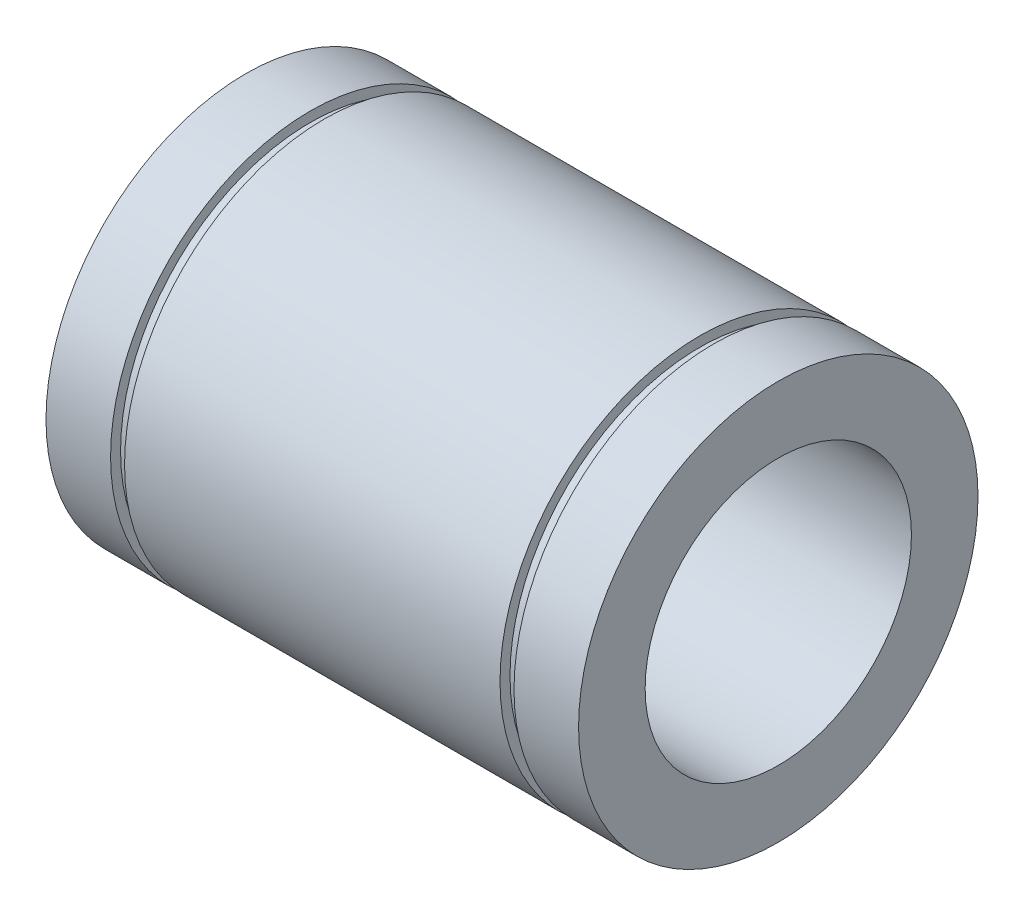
ISO-10303-21;
HEADER;
FILE_DESCRIPTION(('STEP AP214'),'2;1');
FILE_NAME('part.step','',(''),(''),'','','');
FILE_SCHEMA(('AUTOMOTIVE_DESIGN { 1 0 10303 214 1 1 1 1 }'));
ENDSEC;
DATA;
#1=APPLICATION_CONTEXT('core data for automotive mechanical design processes');
#2=APPLICATION_PROTOCOL_DEFINITION('international standard','automotive_design',2000,#1);
#3=PRODUCT_CONTEXT('',#1,'mechanical');
#4=PRODUCT('Part','Part','',(#3));
#5=PRODUCT_RELATED_PRODUCT_CATEGORY('part','',(#4));
#6=PRODUCT_DEFINITION_FORMATION('','',#4);
#7=PRODUCT_DEFINITION_CONTEXT('part definition',#1,'design');
#8=PRODUCT_DEFINITION('design','',#6,#7);
#9=PRODUCT_DEFINITION_SHAPE('','',#8);
#10=(LENGTH_UNIT() NAMED_UNIT(*) SI_UNIT(.MILLI.,.METRE.));
#11=(NAMED_UNIT(*) PLANE_ANGLE_UNIT() SI_UNIT($,.RADIAN.));
#12=(NAMED_UNIT(*) SI_UNIT($,.STERADIAN.) SOLID_ANGLE_UNIT());
#13=UNCERTAINTY_MEASURE_WITH_UNIT(LENGTH_MEASURE(1.E-05),#10,'distance_accuracy_value','');
#14=(GEOMETRIC_REPRESENTATION_CONTEXT(3) GLOBAL_UNCERTAINTY_ASSIGNED_CONTEXT((#13)) GLOBAL_UNIT_ASSIGNED_CONTEXT((#10,
#11,#12)) REPRESENTATION_CONTEXT('',''));
#15=CARTESIAN_POINT('',(0.,0.,0.));
#16=DIRECTION('',(0.,0.,1.));
#17=DIRECTION('',(1.,0.,0.));
#18=AXIS2_PLACEMENT_3D('',#15,#16,#17);
#19=CARTESIAN_POINT('',(40.,0.,0.));
#20=DIRECTION('',(-1.,0.,0.));
#21=DIRECTION('',(0.,0.,-1.));
#22=AXIS2_PLACEMENT_3D('',#19,#20,#21);
#23=CYLINDRICAL_SURFACE('',#22,30.);
#24=CARTESIAN_POINT('',(-40.,0.,0.));
#25=DIRECTION('',(1.,0.,0.));
#26=DIRECTION('',(0.,0.,-1.));
#27=AXIS2_PLACEMENT_3D('',#24,#25,#26);
#28=CIRCLE('',#27,30.);
#29=CARTESIAN_POINT('',(-40.,0.,-30.));
#30=VERTEX_POINT('',#29);
#31=CARTESIAN_POINT('',(-40.,0.,30.));
#32=VERTEX_POINT('',#31);
#33=EDGE_CURVE('E371',#30,#32,#28,.T.);
#34=ORIENTED_EDGE('',*,*,#33,.T.);
#35=DIRECTION('',(1.,0.,0.));
#36=VECTOR('',#35,1.);
#37=CARTESIAN_POINT('',(40.,0.,30.));
#38=LINE('',#37,#36);
#39=CARTESIAN_POINT('',(-30.3,0.,30.));
#40=VERTEX_POINT('',#39);
#41=EDGE_CURVE('E10',#32,#40,#38,.T.);
#42=ORIENTED_EDGE('',*,*,#41,.T.);
#43=CARTESIAN_POINT('',(-30.3,0.,0.));
#44=DIRECTION('',(1.,0.,0.));
#45=DIRECTION('',(0.,0.,-1.));
#46=AXIS2_PLACEMENT_3D('',#43,#44,#45);
#47=CIRCLE('',#46,30.);
#48=CARTESIAN_POINT('',(-30.3,0.,-30.));
#49=VERTEX_POINT('',#48);
#50=EDGE_CURVE('E181',#49,#40,#47,.T.);
#51=ORIENTED_EDGE('',*,*,#50,.F.);
#52=CARTESIAN_POINT('',(-30.3,0.,0.));
#53=DIRECTION('',(1.,0.,0.));
#54=DIRECTION('',(0.,0.,-1.));
#55=AXIS2_PLACEMENT_3D('',#52,#53,#54);
#56=CIRCLE('',#55,30.);
#57=EDGE_CURVE('E20',#40,#49,#56,.T.);
#58=ORIENTED_EDGE('',*,*,#57,.F.);
#59=ORIENTED_EDGE('',*,*,#41,.F.);
#60=CARTESIAN_POINT('',(-40.,0.,0.));
#61=DIRECTION('',(1.,0.,0.));
#62=DIRECTION('',(0.,0.,-1.));
#63=AXIS2_PLACEMENT_3D('',#60,#61,#62);
#64=CIRCLE('',#63,30.);
#65=EDGE_CURVE('E372',#32,#30,#64,.T.);
#66=ORIENTED_EDGE('',*,*,#65,.T.);
#67=EDGE_LOOP('',(#34,#42,#51,#58,#59,#66));
#68=FACE_BOUND('',#67,.T.);
#69=ADVANCED_FACE('F16',(#68),#23,.T.);
#70=CARTESIAN_POINT('',(-30.3,28.5,0.));
#71=DIRECTION('',(1.,0.,0.));
#72=DIRECTION('',(0.,1.,0.));
#73=AXIS2_PLACEMENT_3D('',#70,#71,#72);
#74=PLANE('',#73);
#75=CARTESIAN_POINT('',(-30.3,0.,0.));
#76=DIRECTION('',(1.,0.,0.));
#77=DIRECTION('',(0.,0.,-1.));
#78=AXIS2_PLACEMENT_3D('',#75,#76,#77);
#79=CIRCLE('',#78,28.5);
#80=CARTESIAN_POINT('',(-30.3,0.,-28.5));
#81=VERTEX_POINT('',#80);
#82=CARTESIAN_POINT('',(-30.3,0.,28.5));
#83=VERTEX_POINT('',#82);
#84=EDGE_CURVE('E161',#81,#83,#79,.T.);
#85=ORIENTED_EDGE('',*,*,#84,.F.);
#86=CARTESIAN_POINT('',(-30.3,0.,0.));
#87=DIRECTION('',(1.,0.,0.));
#88=DIRECTION('',(0.,0.,-1.));
#89=AXIS2_PLACEMENT_3D('',#86,#87,#88);
#90=CIRCLE('',#89,28.5);
#91=EDGE_CURVE('E160',#83,#81,#90,.T.);
#92=ORIENTED_EDGE('',*,*,#91,.F.);
#93=EDGE_LOOP('',(#85,#92));
#94=FACE_BOUND('',#93,.T.);
#95=ORIENTED_EDGE('',*,*,#50,.T.);
#96=ORIENTED_EDGE('',*,*,#57,.T.);
#97=EDGE_LOOP('',(#95,#96));
#98=FACE_BOUND('',#97,.T.);
#99=ADVANCED_FACE('F18',(#94,#98),#74,.T.);
#100=CARTESIAN_POINT('',(40.,0.,0.));
#101=DIRECTION('',(-1.,0.,0.));
#102=DIRECTION('',(0.,0.,-1.));
#103=AXIS2_PLACEMENT_3D('',#100,#101,#102);
#104=CYLINDRICAL_SURFACE('',#103,28.5);
#105=ORIENTED_EDGE('',*,*,#84,.T.);
#106=DIRECTION('',(1.,0.,0.));
#107=VECTOR('',#106,1.);
#108=CARTESIAN_POINT('',(40.,0.,28.5));
#109=LINE('',#108,#107);
#110=CARTESIAN_POINT('',(-28.2,0.,28.5));
#111=VERTEX_POINT('',#110);
#112=EDGE_CURVE('E158',#83,#111,#109,.T.);
#113=ORIENTED_EDGE('',*,*,#112,.T.);
#114=CARTESIAN_POINT('',(-28.2,0.,0.));
#115=DIRECTION('',(1.,0.,0.));
#116=DIRECTION('',(0.,0.,-1.));
#117=AXIS2_PLACEMENT_3D('',#114,#115,#116);
#118=CIRCLE('',#117,28.5);
#119=CARTESIAN_POINT('',(-28.2,0.,-28.5));
#120=VERTEX_POINT('',#119);
#121=EDGE_CURVE('E170',#120,#111,#118,.T.);
#122=ORIENTED_EDGE('',*,*,#121,.F.);
#123=CARTESIAN_POINT('',(-28.2,0.,0.));
#124=DIRECTION('',(1.,0.,0.));
#125=DIRECTION('',(0.,0.,-1.));
#126=AXIS2_PLACEMENT_3D('',#123,#124,#125);
#127=CIRCLE('',#126,28.5);
#128=EDGE_CURVE('E174',#111,#120,#127,.T.);
#129=ORIENTED_EDGE('',*,*,#128,.F.);
#130=ORIENTED_EDGE('',*,*,#112,.F.);
#131=ORIENTED_EDGE('',*,*,#91,.T.);
#132=EDGE_LOOP('',(#105,#113,#122,#129,#130,#131));
#133=FACE_BOUND('',#132,.T.);
#134=ADVANCED_FACE('F200',(#133),#104,.T.);
#135=CARTESIAN_POINT('',(-28.2,30.,0.));
#136=DIRECTION('',(-1.,0.,0.));
#137=DIRECTION('',(0.,0.,1.));
#138=AXIS2_PLACEMENT_3D('',#135,#136,#137);
#139=PLANE('',#138);
#140=ORIENTED_EDGE('',*,*,#121,.T.);
#141=ORIENTED_EDGE('',*,*,#128,.T.);
#142=EDGE_LOOP('',(#140,#141));
#143=FACE_BOUND('',#142,.T.);
#144=CARTESIAN_POINT('',(-28.2,0.,0.));
#145=DIRECTION('',(1.,0.,0.));
#146=DIRECTION('',(0.,0.,-1.));
#147=AXIS2_PLACEMENT_3D('',#144,#145,#146);
#148=CIRCLE('',#147,30.);
#149=CARTESIAN_POINT('',(-28.2,0.,-30.));
#150=VERTEX_POINT('',#149);
#151=CARTESIAN_POINT('',(-28.2,0.,30.));
#152=VERTEX_POINT('',#151);
#153=EDGE_CURVE('E141',#150,#152,#148,.T.);
#154=ORIENTED_EDGE('',*,*,#153,.F.);
#155=CARTESIAN_POINT('',(-28.2,0.,0.));
#156=DIRECTION('',(1.,0.,0.));
#157=DIRECTION('',(0.,0.,-1.));
#158=AXIS2_PLACEMENT_3D('',#155,#156,#157);
#159=CIRCLE('',#158,30.);
#160=EDGE_CURVE('E166',#152,#150,#159,.T.);
#161=ORIENTED_EDGE('',*,*,#160,.F.);
#162=EDGE_LOOP('',(#154,#161));
#163=FACE_BOUND('',#162,.T.);
#164=ADVANCED_FACE('F205',(#143,#163),#139,.T.);
#165=CARTESIAN_POINT('',(40.,0.,0.));
#166=DIRECTION('',(-1.,0.,0.));
#167=DIRECTION('',(0.,0.,-1.));
#168=AXIS2_PLACEMENT_3D('',#165,#166,#167);
#169=CYLINDRICAL_SURFACE('',#168,30.);
#170=ORIENTED_EDGE('',*,*,#153,.T.);
#171=DIRECTION('',(1.,0.,0.));
#172=VECTOR('',#171,1.);
#173=CARTESIAN_POINT('',(40.,0.,30.));
#174=LINE('',#173,#172);
#175=CARTESIAN_POINT('',(28.2,0.,30.));
#176=VERTEX_POINT('',#175);
#177=EDGE_CURVE('E145',#152,#176,#174,.T.);
#178=ORIENTED_EDGE('',*,*,#177,.T.);
#179=CARTESIAN_POINT('',(28.2,0.,0.));
#180=DIRECTION('',(1.,0.,0.));
#181=DIRECTION('',(0.,0.,-1.));
#182=AXIS2_PLACEMENT_3D('',#179,#180,#181);
#183=CIRCLE('',#182,30.);
#184=CARTESIAN_POINT('',(28.2,0.,-30.));
#185=VERTEX_POINT('',#184);
#186=EDGE_CURVE('E137',#185,#176,#183,.T.);
#187=ORIENTED_EDGE('',*,*,#186,.F.);
#188=CARTESIAN_POINT('',(28.2,0.,0.));
#189=DIRECTION('',(1.,0.,0.));
#190=DIRECTION('',(0.,0.,-1.));
#191=AXIS2_PLACEMENT_3D('',#188,#189,#190);
#192=CIRCLE('',#191,30.);
#193=EDGE_CURVE('E134',#176,#185,#192,.T.);
#194=ORIENTED_EDGE('',*,*,#193,.F.);
#195=ORIENTED_EDGE('',*,*,#177,.F.);
#196=ORIENTED_EDGE('',*,*,#160,.T.);
#197=EDGE_LOOP('',(#170,#178,#187,#194,#195,#196));
#198=FACE_BOUND('',#197,.T.);
#199=ADVANCED_FACE('F144',(#198),#169,.T.);
#200=CARTESIAN_POINT('',(28.2,28.5,0.));
#201=DIRECTION('',(1.,0.,0.));
#202=DIRECTION('',(0.,1.,0.));
#203=AXIS2_PLACEMENT_3D('',#200,#201,#202);
#204=PLANE('',#203);
#205=CARTESIAN_POINT('',(28.2,0.,0.));
#206=DIRECTION('',(1.,0.,0.));
#207=DIRECTION('',(0.,0.,-1.));
#208=AXIS2_PLACEMENT_3D('',#205,#206,#207);
#209=CIRCLE('',#208,28.5);
#210=CARTESIAN_POINT('',(28.2,0.,-28.5));
#211=VERTEX_POINT('',#210);
#212=CARTESIAN_POINT('',(28.2,0.,28.5));
#213=VERTEX_POINT('',#212);
#214=EDGE_CURVE('E382',#211,#213,#209,.T.);
#215=ORIENTED_EDGE('',*,*,#214,.F.);
#216=CARTESIAN_POINT('',(28.2,0.,0.));
#217=DIRECTION('',(1.,0.,0.));
#218=DIRECTION('',(0.,0.,-1.));
#219=AXIS2_PLACEMENT_3D('',#216,#217,#218);
#220=CIRCLE('',#219,28.5);
#221=EDGE_CURVE('E147',#213,#211,#220,.T.);
#222=ORIENTED_EDGE('',*,*,#221,.F.);
#223=EDGE_LOOP('',(#215,#222));
#224=FACE_BOUND('',#223,.T.);
#225=ORIENTED_EDGE('',*,*,#186,.T.);
#226=ORIENTED_EDGE('',*,*,#193,.T.);
#227=EDGE_LOOP('',(#225,#226));
#228=FACE_BOUND('',#227,.T.);
#229=ADVANCED_FACE('F136',(#224,#228),#204,.T.);
#230=CARTESIAN_POINT('',(40.,0.,0.));
#231=DIRECTION('',(-1.,0.,0.));
#232=DIRECTION('',(0.,0.,-1.));
#233=AXIS2_PLACEMENT_3D('',#230,#231,#232);
#234=CYLINDRICAL_SURFACE('',#233,28.5);
#235=ORIENTED_EDGE('',*,*,#214,.T.);
#236=DIRECTION('',(1.,0.,0.));
#237=VECTOR('',#236,1.);
#238=CARTESIAN_POINT('',(40.,0.,28.5));
#239=LINE('',#238,#237);
#240=CARTESIAN_POINT('',(30.3,0.,28.5));
#241=VERTEX_POINT('',#240);
#242=EDGE_CURVE('E153',#213,#241,#239,.T.);
#243=ORIENTED_EDGE('',*,*,#242,.T.);
#244=CARTESIAN_POINT('',(30.3,0.,0.));
#245=DIRECTION('',(1.,0.,0.));
#246=DIRECTION('',(0.,0.,-1.));
#247=AXIS2_PLACEMENT_3D('',#244,#245,#246);
#248=CIRCLE('',#247,28.5);
#249=CARTESIAN_POINT('',(30.3,0.,-28.5));
#250=VERTEX_POINT('',#249);
#251=EDGE_CURVE('E417',#250,#241,#248,.T.);
#252=ORIENTED_EDGE('',*,*,#251,.F.);
#253=CARTESIAN_POINT('',(30.3,0.,0.));
#254=DIRECTION('',(1.,0.,0.));
#255=DIRECTION('',(0.,0.,-1.));
#256=AXIS2_PLACEMENT_3D('',#253,#254,#255);
#257=CIRCLE('',#256,28.5);
#258=EDGE_CURVE('E381',#241,#250,#257,.T.);
#259=ORIENTED_EDGE('',*,*,#258,.F.);
#260=ORIENTED_EDGE('',*,*,#242,.F.);
#261=ORIENTED_EDGE('',*,*,#221,.T.);
#262=EDGE_LOOP('',(#235,#243,#252,#259,#260,#261));
#263=FACE_BOUND('',#262,.T.);
#264=ADVANCED_FACE('F216',(#263),#234,.T.);
#265=CARTESIAN_POINT('',(30.3,30.,0.));
#266=DIRECTION('',(-1.,0.,0.));
#267=DIRECTION('',(0.,0.,1.));
#268=AXIS2_PLACEMENT_3D('',#265,#266,#267);
#269=PLANE('',#268);
#270=ORIENTED_EDGE('',*,*,#251,.T.);
#271=ORIENTED_EDGE('',*,*,#258,.T.);
#272=EDGE_LOOP('',(#270,#271));
#273=FACE_BOUND('',#272,.T.);
#274=CARTESIAN_POINT('',(30.3,0.,0.));
#275=DIRECTION('',(1.,0.,0.));
#276=DIRECTION('',(0.,0.,-1.));
#277=AXIS2_PLACEMENT_3D('',#274,#275,#276);
#278=CIRCLE('',#277,30.);
#279=CARTESIAN_POINT('',(30.3,0.,-30.));
#280=VERTEX_POINT('',#279);
#281=CARTESIAN_POINT('',(30.3,0.,30.));
#282=VERTEX_POINT('',#281);
#283=EDGE_CURVE('E389',#280,#282,#278,.T.);
#284=ORIENTED_EDGE('',*,*,#283,.F.);
#285=CARTESIAN_POINT('',(30.3,0.,0.));
#286=DIRECTION('',(1.,0.,0.));
#287=DIRECTION('',(0.,0.,-1.));
#288=AXIS2_PLACEMENT_3D('',#285,#286,#287);
#289=CIRCLE('',#288,30.);
#290=EDGE_CURVE('E415',#282,#280,#289,.T.);
#291=ORIENTED_EDGE('',*,*,#290,.F.);
#292=EDGE_LOOP('',(#284,#291));
#293=FACE_BOUND('',#292,.T.);
#294=ADVANCED_FACE('F222',(#273,#293),#269,.T.);
#295=CARTESIAN_POINT('',(40.,0.,0.));
#296=DIRECTION('',(-1.,0.,0.));
#297=DIRECTION('',(0.,0.,-1.));
#298=AXIS2_PLACEMENT_3D('',#295,#296,#297);
#299=CYLINDRICAL_SURFACE('',#298,30.);
#300=ORIENTED_EDGE('',*,*,#283,.T.);
#301=DIRECTION('',(1.,0.,0.));
#302=VECTOR('',#301,1.);
#303=CARTESIAN_POINT('',(40.,0.,30.));
#304=LINE('',#303,#302);
#305=CARTESIAN_POINT('',(40.,0.,30.));
#306=VERTEX_POINT('',#305);
#307=EDGE_CURVE('E393',#282,#306,#304,.T.);
#308=ORIENTED_EDGE('',*,*,#307,.T.);
#309=CARTESIAN_POINT('',(40.,0.,0.));
#310=DIRECTION('',(1.,0.,0.));
#311=DIRECTION('',(0.,0.,-1.));
#312=AXIS2_PLACEMENT_3D('',#309,#310,#311);
#313=CIRCLE('',#312,30.);
#314=CARTESIAN_POINT('',(40.,0.,-30.));
#315=VERTEX_POINT('',#314);
#316=EDGE_CURVE('E398',#315,#306,#313,.T.);
#317=ORIENTED_EDGE('',*,*,#316,.F.);
#318=CARTESIAN_POINT('',(40.,0.,0.));
#319=DIRECTION('',(1.,0.,0.));
#320=DIRECTION('',(0.,0.,-1.));
#321=AXIS2_PLACEMENT_3D('',#318,#319,#320);
#322=CIRCLE('',#321,30.);
#323=EDGE_CURVE('E394',#306,#315,#322,.T.);
#324=ORIENTED_EDGE('',*,*,#323,.F.);
#325=ORIENTED_EDGE('',*,*,#307,.F.);
#326=ORIENTED_EDGE('',*,*,#290,.T.);
#327=EDGE_LOOP('',(#300,#308,#317,#324,#325,#326));
#328=FACE_BOUND('',#327,.T.);
#329=ADVANCED_FACE('F226',(#328),#299,.T.);
#330=CARTESIAN_POINT('',(40.,20.,0.));
#331=DIRECTION('',(1.,0.,0.));
#332=DIRECTION('',(0.,1.,0.));
#333=AXIS2_PLACEMENT_3D('',#330,#331,#332);
#334=PLANE('',#333);
#335=CARTESIAN_POINT('',(40.,0.,0.));
#336=DIRECTION('',(1.,0.,0.));
#337=DIRECTION('',(0.,0.,-1.));
#338=AXIS2_PLACEMENT_3D('',#335,#336,#337);
#339=CIRCLE('',#338,20.);
#340=CARTESIAN_POINT('',(40.,0.,-20.));
#341=VERTEX_POINT('',#340);
#342=CARTESIAN_POINT('',(40.,0.,20.));
#343=VERTEX_POINT('',#342);
#344=EDGE_CURVE('E401',#341,#343,#339,.T.);
#345=ORIENTED_EDGE('',*,*,#344,.F.);
#346=CARTESIAN_POINT('',(40.,0.,0.));
#347=DIRECTION('',(1.,0.,0.));
#348=DIRECTION('',(0.,0.,-1.));
#349=AXIS2_PLACEMENT_3D('',#346,#347,#348);
#350=CIRCLE('',#349,20.);
#351=EDGE_CURVE('E395',#343,#341,#350,.T.);
#352=ORIENTED_EDGE('',*,*,#351,.F.);
#353=EDGE_LOOP('',(#345,#352));
#354=FACE_BOUND('',#353,.T.);
#355=ORIENTED_EDGE('',*,*,#316,.T.);
#356=ORIENTED_EDGE('',*,*,#323,.T.);
#357=EDGE_LOOP('',(#355,#356));
#358=FACE_BOUND('',#357,.T.);
#359=ADVANCED_FACE('F235',(#354,#358),#334,.T.);
#360=CARTESIAN_POINT('',(40.,0.,0.));
#361=DIRECTION('',(-1.,0.,0.));
#362=DIRECTION('',(0.,0.,-1.));
#363=AXIS2_PLACEMENT_3D('',#360,#361,#362);
#364=CYLINDRICAL_SURFACE('',#363,20.);
#365=ORIENTED_EDGE('',*,*,#344,.T.);
#366=DIRECTION('',(-1.,0.,0.));
#367=VECTOR('',#366,1.);
#368=CARTESIAN_POINT('',(40.,0.,20.));
#369=LINE('',#368,#367);
#370=CARTESIAN_POINT('',(-40.,0.,20.));
#371=VERTEX_POINT('',#370);
#372=EDGE_CURVE('E399',#343,#371,#369,.T.);
#373=ORIENTED_EDGE('',*,*,#372,.T.);
#374=CARTESIAN_POINT('',(-40.,0.,0.));
#375=DIRECTION('',(1.,0.,0.));
#376=DIRECTION('',(0.,0.,-1.));
#377=AXIS2_PLACEMENT_3D('',#374,#375,#376);
#378=CIRCLE('',#377,20.);
#379=CARTESIAN_POINT('',(-40.,0.,-20.));
#380=VERTEX_POINT('',#379);
#381=EDGE_CURVE('E368',#380,#371,#378,.T.);
#382=ORIENTED_EDGE('',*,*,#381,.F.);
#383=CARTESIAN_POINT('',(-40.,0.,0.));
#384=DIRECTION('',(1.,0.,0.));
#385=DIRECTION('',(0.,0.,-1.));
#386=AXIS2_PLACEMENT_3D('',#383,#384,#385);
#387=CIRCLE('',#386,20.);
#388=EDGE_CURVE('E387',#371,#380,#387,.T.);
#389=ORIENTED_EDGE('',*,*,#388,.F.);
#390=ORIENTED_EDGE('',*,*,#372,.F.);
#391=ORIENTED_EDGE('',*,*,#351,.T.);
#392=EDGE_LOOP('',(#365,#373,#382,#389,#390,#391));
#393=FACE_BOUND('',#392,.T.);
#394=ADVANCED_FACE('F244',(#393),#364,.F.);
#395=CARTESIAN_POINT('',(-40.,30.,0.));
#396=DIRECTION('',(-1.,0.,0.));
#397=DIRECTION('',(0.,0.,1.));
#398=AXIS2_PLACEMENT_3D('',#395,#396,#397);
#399=PLANE('',#398);
#400=ORIENTED_EDGE('',*,*,#381,.T.);
#401=ORIENTED_EDGE('',*,*,#388,.T.);
#402=EDGE_LOOP('',(#400,#401));
#403=FACE_BOUND('',#402,.T.);
#404=ORIENTED_EDGE('',*,*,#33,.F.);
#405=ORIENTED_EDGE('',*,*,#65,.F.);
#406=EDGE_LOOP('',(#404,#405));
#407=FACE_BOUND('',#406,.T.);
#408=ADVANCED_FACE('F261',(#403,#407),#399,.T.);
#409=CLOSED_SHELL('',(#69,#99,#134,#164,#199,#229,#264,#294,#329,#359,#394,#408));
#410=MANIFOLD_SOLID_BREP('B1',#409);
#411=ADVANCED_BREP_SHAPE_REPRESENTATION('',(#18,#410),#14);
#412=SHAPE_DEFINITION_REPRESENTATION(#9,#411);
ENDSEC;
END-ISO-10303-21;
